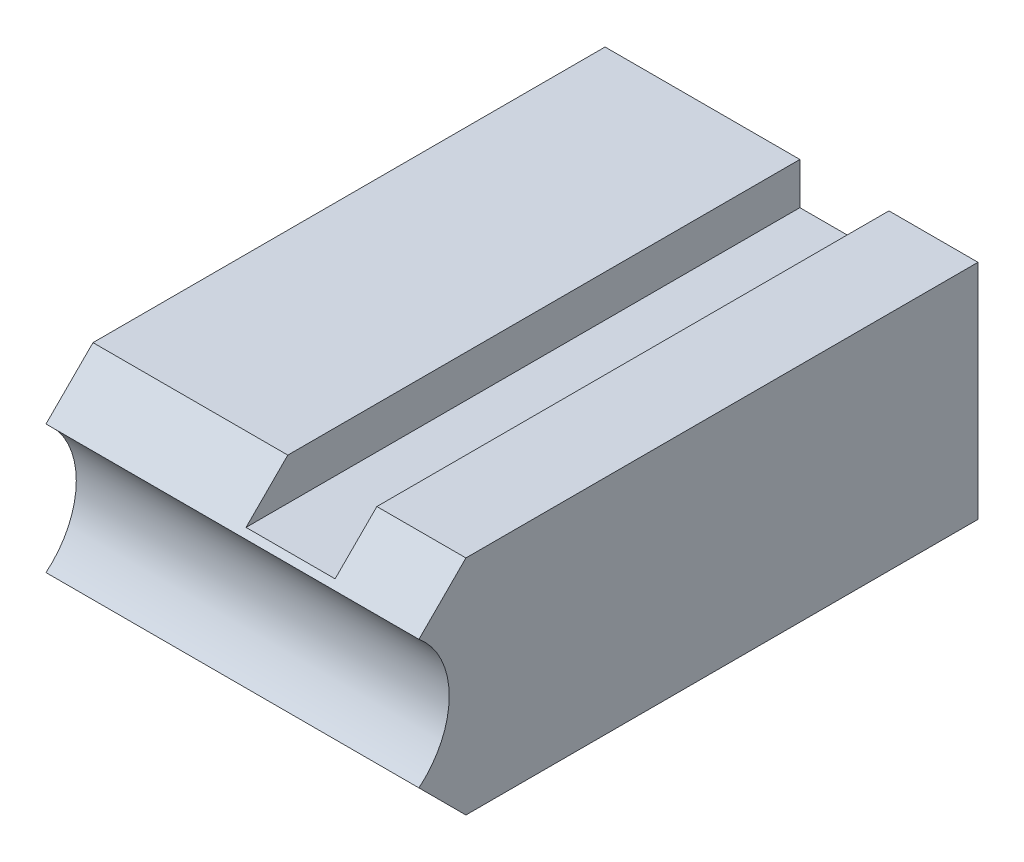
ISO-10303-21;
HEADER;
FILE_DESCRIPTION(('STEP AP214'),'2;1');
FILE_NAME('part.step','',(''),(''),'','','');
FILE_SCHEMA(('AUTOMOTIVE_DESIGN { 1 0 10303 214 1 1 1 1 }'));
ENDSEC;
DATA;
#1=APPLICATION_CONTEXT('core data for automotive mechanical design processes');
#2=APPLICATION_PROTOCOL_DEFINITION('international standard','automotive_design',2000,#1);
#3=PRODUCT_CONTEXT('',#1,'mechanical');
#4=PRODUCT('Part','Part','',(#3));
#5=PRODUCT_RELATED_PRODUCT_CATEGORY('part','',(#4));
#6=PRODUCT_DEFINITION_FORMATION('','',#4);
#7=PRODUCT_DEFINITION_CONTEXT('part definition',#1,'design');
#8=PRODUCT_DEFINITION('design','',#6,#7);
#9=PRODUCT_DEFINITION_SHAPE('','',#8);
#10=(LENGTH_UNIT() NAMED_UNIT(*) SI_UNIT(.MILLI.,.METRE.));
#11=(NAMED_UNIT(*) PLANE_ANGLE_UNIT() SI_UNIT($,.RADIAN.));
#12=(NAMED_UNIT(*) SI_UNIT($,.STERADIAN.) SOLID_ANGLE_UNIT());
#13=UNCERTAINTY_MEASURE_WITH_UNIT(LENGTH_MEASURE(1.E-05),#10,'distance_accuracy_value','');
#14=(GEOMETRIC_REPRESENTATION_CONTEXT(3) GLOBAL_UNCERTAINTY_ASSIGNED_CONTEXT((#13)) GLOBAL_UNIT_ASSIGNED_CONTEXT((#10,
#11,#12)) REPRESENTATION_CONTEXT('',''));
#15=CARTESIAN_POINT('',(0.,0.,0.));
#16=DIRECTION('',(0.,0.,1.));
#17=DIRECTION('',(1.,0.,0.));
#18=AXIS2_PLACEMENT_3D('',#15,#16,#17);
#19=CARTESIAN_POINT('',(118.,12.5,-110.));
#20=DIRECTION('',(0.,1.,0.));
#21=DIRECTION('',(-1.,0.,0.));
#22=AXIS2_PLACEMENT_3D('',#19,#20,#21);
#23=PLANE('',#22);
#24=DIRECTION('',(-1.,0.,0.));
#25=VECTOR('',#24,1.);
#26=CARTESIAN_POINT('',(118.,12.5,-10.5));
#27=LINE('',#26,#25);
#28=CARTESIAN_POINT('',(134.,12.5,-10.5));
#29=VERTEX_POINT('',#28);
#30=CARTESIAN_POINT('',(118.,12.5,-10.5));
#31=VERTEX_POINT('',#30);
#32=EDGE_CURVE('E198',#29,#31,#27,.T.);
#33=ORIENTED_EDGE('',*,*,#32,.F.);
#34=DIRECTION('',(0.,0.,1.));
#35=VECTOR('',#34,1.);
#36=CARTESIAN_POINT('',(134.,12.5,-110.));
#37=LINE('',#36,#35);
#38=CARTESIAN_POINT('',(134.,12.5,-110.));
#39=VERTEX_POINT('',#38);
#40=EDGE_CURVE('E161',#39,#29,#37,.T.);
#41=ORIENTED_EDGE('',*,*,#40,.F.);
#42=DIRECTION('',(-1.,0.,0.));
#43=VECTOR('',#42,1.);
#44=CARTESIAN_POINT('',(118.,12.5,-110.));
#45=LINE('',#44,#43);
#46=CARTESIAN_POINT('',(118.,12.5,-110.));
#47=VERTEX_POINT('',#46);
#48=EDGE_CURVE('E53',#39,#47,#45,.T.);
#49=ORIENTED_EDGE('',*,*,#48,.T.);
#50=DIRECTION('',(0.,0.,1.));
#51=VECTOR('',#50,1.);
#52=CARTESIAN_POINT('',(118.,12.5,-110.));
#53=LINE('',#52,#51);
#54=EDGE_CURVE('E39',#47,#31,#53,.T.);
#55=ORIENTED_EDGE('',*,*,#54,.T.);
#56=EDGE_LOOP('',(#33,#41,#49,#55));
#57=FACE_BOUND('',#56,.T.);
#58=ADVANCED_FACE('F31',(#57),#23,.T.);
#59=CARTESIAN_POINT('',(134.,12.5,-110.));
#60=DIRECTION('',(-1.,0.,0.));
#61=DIRECTION('',(0.,0.,1.));
#62=AXIS2_PLACEMENT_3D('',#59,#60,#61);
#63=PLANE('',#62);
#64=DIRECTION('',(0.,-0.707106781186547,0.707106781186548));
#65=VECTOR('',#64,1.);
#66=CARTESIAN_POINT('',(134.,62.25,-60.25));
#67=LINE('',#66,#65);
#68=CARTESIAN_POINT('',(134.,20.,-18.));
#69=VERTEX_POINT('',#68);
#70=EDGE_CURVE('E195',#69,#29,#67,.T.);
#71=ORIENTED_EDGE('',*,*,#70,.F.);
#72=DIRECTION('',(0.,0.,1.));
#73=VECTOR('',#72,1.);
#74=CARTESIAN_POINT('',(134.,20.,-110.));
#75=LINE('',#74,#73);
#76=CARTESIAN_POINT('',(134.,20.,-110.));
#77=VERTEX_POINT('',#76);
#78=EDGE_CURVE('E151',#77,#69,#75,.T.);
#79=ORIENTED_EDGE('',*,*,#78,.F.);
#80=DIRECTION('',(0.,-1.,0.));
#81=VECTOR('',#80,1.);
#82=CARTESIAN_POINT('',(134.,12.5,-110.));
#83=LINE('',#82,#81);
#84=EDGE_CURVE('E189',#77,#39,#83,.T.);
#85=ORIENTED_EDGE('',*,*,#84,.T.);
#86=ORIENTED_EDGE('',*,*,#40,.T.);
#87=EDGE_LOOP('',(#71,#79,#85,#86));
#88=FACE_BOUND('',#87,.T.);
#89=ADVANCED_FACE('F194',(#88),#63,.T.);
#90=CARTESIAN_POINT('',(134.,20.,-110.));
#91=DIRECTION('',(0.,1.,0.));
#92=DIRECTION('',(0.,0.,1.));
#93=AXIS2_PLACEMENT_3D('',#90,#91,#92);
#94=PLANE('',#93);
#95=DIRECTION('',(-1.,0.,0.));
#96=VECTOR('',#95,1.);
#97=CARTESIAN_POINT('',(150.,20.,-18.));
#98=LINE('',#97,#96);
#99=CARTESIAN_POINT('',(150.,20.,-18.));
#100=VERTEX_POINT('',#99);
#101=EDGE_CURVE('E134',#100,#69,#98,.T.);
#102=ORIENTED_EDGE('',*,*,#101,.F.);
#103=DIRECTION('',(0.,0.,1.));
#104=VECTOR('',#103,1.);
#105=CARTESIAN_POINT('',(150.,20.,-110.));
#106=LINE('',#105,#104);
#107=CARTESIAN_POINT('',(150.,20.,-110.));
#108=VERTEX_POINT('',#107);
#109=EDGE_CURVE('E149',#108,#100,#106,.T.);
#110=ORIENTED_EDGE('',*,*,#109,.F.);
#111=DIRECTION('',(-1.,0.,0.));
#112=VECTOR('',#111,1.);
#113=CARTESIAN_POINT('',(134.,20.,-110.));
#114=LINE('',#113,#112);
#115=EDGE_CURVE('E275',#108,#77,#114,.T.);
#116=ORIENTED_EDGE('',*,*,#115,.T.);
#117=ORIENTED_EDGE('',*,*,#78,.T.);
#118=EDGE_LOOP('',(#102,#110,#116,#117));
#119=FACE_BOUND('',#118,.T.);
#120=ADVANCED_FACE('F147',(#119),#94,.T.);
#121=CARTESIAN_POINT('',(150.,20.,-110.));
#122=DIRECTION('',(1.,0.,0.));
#123=DIRECTION('',(0.,0.,-1.));
#124=AXIS2_PLACEMENT_3D('',#121,#122,#123);
#125=PLANE('',#124);
#126=DIRECTION('',(0.,-0.707106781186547,-0.707106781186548));
#127=VECTOR('',#126,1.);
#128=CARTESIAN_POINT('',(150.,-20.,-18.));
#129=LINE('',#128,#127);
#130=CARTESIAN_POINT('',(150.,-11.5593560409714,-9.55935604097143));
#131=VERTEX_POINT('',#130);
#132=CARTESIAN_POINT('',(150.,-20.,-18.));
#133=VERTEX_POINT('',#132);
#134=EDGE_CURVE('E281',#131,#133,#129,.T.);
#135=ORIENTED_EDGE('',*,*,#134,.T.);
#136=DIRECTION('',(0.,0.,1.));
#137=VECTOR('',#136,1.);
#138=CARTESIAN_POINT('',(150.,-20.,-110.));
#139=LINE('',#138,#137);
#140=CARTESIAN_POINT('',(150.,-20.,-110.));
#141=VERTEX_POINT('',#140);
#142=EDGE_CURVE('E159',#141,#133,#139,.T.);
#143=ORIENTED_EDGE('',*,*,#142,.F.);
#144=DIRECTION('',(0.,1.,0.));
#145=VECTOR('',#144,1.);
#146=CARTESIAN_POINT('',(150.,20.,-110.));
#147=LINE('',#146,#145);
#148=EDGE_CURVE('E158',#141,#108,#147,.T.);
#149=ORIENTED_EDGE('',*,*,#148,.T.);
#150=ORIENTED_EDGE('',*,*,#109,.T.);
#151=DIRECTION('',(0.,-0.707106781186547,0.707106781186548));
#152=VECTOR('',#151,1.);
#153=CARTESIAN_POINT('',(150.,20.,-18.));
#154=LINE('',#153,#152);
#155=CARTESIAN_POINT('',(150.,11.5593560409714,-9.55935604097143));
#156=VERTEX_POINT('',#155);
#157=EDGE_CURVE('E131',#100,#156,#154,.T.);
#158=ORIENTED_EDGE('',*,*,#157,.T.);
#159=CARTESIAN_POINT('',(150.,0.,0.));
#160=DIRECTION('',(-1.,0.,0.));
#161=DIRECTION('',(0.,0.,-1.));
#162=AXIS2_PLACEMENT_3D('',#159,#160,#161);
#163=CIRCLE('',#162,15.);
#164=EDGE_CURVE('E142',#156,#131,#163,.T.);
#165=ORIENTED_EDGE('',*,*,#164,.T.);
#166=EDGE_LOOP('',(#135,#143,#149,#150,#158,#165));
#167=FACE_BOUND('',#166,.T.);
#168=ADVANCED_FACE('F156',(#167),#125,.T.);
#169=CARTESIAN_POINT('',(134.,-20.,-110.));
#170=DIRECTION('',(0.,-1.,0.));
#171=DIRECTION('',(0.,0.,-1.));
#172=AXIS2_PLACEMENT_3D('',#169,#170,#171);
#173=PLANE('',#172);
#174=DIRECTION('',(-1.,0.,0.));
#175=VECTOR('',#174,1.);
#176=CARTESIAN_POINT('',(150.,-20.,-18.));
#177=LINE('',#176,#175);
#178=CARTESIAN_POINT('',(134.,-20.,-18.));
#179=VERTEX_POINT('',#178);
#180=EDGE_CURVE('E250',#133,#179,#177,.T.);
#181=ORIENTED_EDGE('',*,*,#180,.T.);
#182=DIRECTION('',(0.,0.,1.));
#183=VECTOR('',#182,1.);
#184=CARTESIAN_POINT('',(134.,-20.,-110.));
#185=LINE('',#184,#183);
#186=CARTESIAN_POINT('',(134.,-20.,-110.));
#187=VERTEX_POINT('',#186);
#188=EDGE_CURVE('E164',#187,#179,#185,.T.);
#189=ORIENTED_EDGE('',*,*,#188,.F.);
#190=DIRECTION('',(1.,0.,0.));
#191=VECTOR('',#190,1.);
#192=CARTESIAN_POINT('',(134.,-20.,-110.));
#193=LINE('',#192,#191);
#194=EDGE_CURVE('E272',#187,#141,#193,.T.);
#195=ORIENTED_EDGE('',*,*,#194,.T.);
#196=ORIENTED_EDGE('',*,*,#142,.T.);
#197=EDGE_LOOP('',(#181,#189,#195,#196));
#198=FACE_BOUND('',#197,.T.);
#199=ADVANCED_FACE('F266',(#198),#173,.T.);
#200=CARTESIAN_POINT('',(134.,-12.5,-110.));
#201=DIRECTION('',(-1.,0.,0.));
#202=DIRECTION('',(0.,0.,1.));
#203=AXIS2_PLACEMENT_3D('',#200,#201,#202);
#204=PLANE('',#203);
#205=DIRECTION('',(0.,-0.707106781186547,-0.707106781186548));
#206=VECTOR('',#205,1.);
#207=CARTESIAN_POINT('',(134.,-62.25,-60.25));
#208=LINE('',#207,#206);
#209=CARTESIAN_POINT('',(134.,-12.5,-10.5));
#210=VERTEX_POINT('',#209);
#211=EDGE_CURVE('E204',#210,#179,#208,.T.);
#212=ORIENTED_EDGE('',*,*,#211,.F.);
#213=DIRECTION('',(0.,0.,1.));
#214=VECTOR('',#213,1.);
#215=CARTESIAN_POINT('',(134.,-12.5,-110.));
#216=LINE('',#215,#214);
#217=CARTESIAN_POINT('',(134.,-12.5,-110.));
#218=VERTEX_POINT('',#217);
#219=EDGE_CURVE('E170',#218,#210,#216,.T.);
#220=ORIENTED_EDGE('',*,*,#219,.F.);
#221=DIRECTION('',(0.,-1.,0.));
#222=VECTOR('',#221,1.);
#223=CARTESIAN_POINT('',(134.,-12.5,-110.));
#224=LINE('',#223,#222);
#225=EDGE_CURVE('E181',#218,#187,#224,.T.);
#226=ORIENTED_EDGE('',*,*,#225,.T.);
#227=ORIENTED_EDGE('',*,*,#188,.T.);
#228=EDGE_LOOP('',(#212,#220,#226,#227));
#229=FACE_BOUND('',#228,.T.);
#230=ADVANCED_FACE('F270',(#229),#204,.T.);
#231=CARTESIAN_POINT('',(118.,-12.5,-110.));
#232=DIRECTION('',(0.,-1.,0.));
#233=DIRECTION('',(1.,0.,0.));
#234=AXIS2_PLACEMENT_3D('',#231,#232,#233);
#235=PLANE('',#234);
#236=DIRECTION('',(1.,0.,0.));
#237=VECTOR('',#236,1.);
#238=CARTESIAN_POINT('',(118.,-12.5,-10.5));
#239=LINE('',#238,#237);
#240=CARTESIAN_POINT('',(118.,-12.5,-10.5));
#241=VERTEX_POINT('',#240);
#242=EDGE_CURVE('E254',#241,#210,#239,.T.);
#243=ORIENTED_EDGE('',*,*,#242,.F.);
#244=DIRECTION('',(0.,0.,1.));
#245=VECTOR('',#244,1.);
#246=CARTESIAN_POINT('',(118.,-12.5,-110.));
#247=LINE('',#246,#245);
#248=CARTESIAN_POINT('',(118.,-12.5,-110.));
#249=VERTEX_POINT('',#248);
#250=EDGE_CURVE('E173',#249,#241,#247,.T.);
#251=ORIENTED_EDGE('',*,*,#250,.F.);
#252=DIRECTION('',(1.,0.,0.));
#253=VECTOR('',#252,1.);
#254=CARTESIAN_POINT('',(118.,-12.5,-110.));
#255=LINE('',#254,#253);
#256=EDGE_CURVE('E178',#249,#218,#255,.T.);
#257=ORIENTED_EDGE('',*,*,#256,.T.);
#258=ORIENTED_EDGE('',*,*,#219,.T.);
#259=EDGE_LOOP('',(#243,#251,#257,#258));
#260=FACE_BOUND('',#259,.T.);
#261=ADVANCED_FACE('F33',(#260),#235,.T.);
#262=CARTESIAN_POINT('',(118.,12.5,-110.));
#263=DIRECTION('',(0.,0.,-1.));
#264=DIRECTION('',(-1.,0.,0.));
#265=AXIS2_PLACEMENT_3D('',#262,#263,#264);
#266=PLANE('',#265);
#267=ORIENTED_EDGE('',*,*,#256,.F.);
#268=DIRECTION('',(0.,1.,0.));
#269=VECTOR('',#268,1.);
#270=CARTESIAN_POINT('',(118.,20.,-110.));
#271=LINE('',#270,#269);
#272=CARTESIAN_POINT('',(118.,-20.,-110.));
#273=VERTEX_POINT('',#272);
#274=EDGE_CURVE('E220',#273,#249,#271,.T.);
#275=ORIENTED_EDGE('',*,*,#274,.F.);
#276=DIRECTION('',(1.,0.,0.));
#277=VECTOR('',#276,1.);
#278=CARTESIAN_POINT('',(118.,-20.,-110.));
#279=LINE('',#278,#277);
#280=CARTESIAN_POINT('',(83.,-20.,-110.));
#281=VERTEX_POINT('',#280);
#282=EDGE_CURVE('E213',#281,#273,#279,.T.);
#283=ORIENTED_EDGE('',*,*,#282,.F.);
#284=DIRECTION('',(0.,-1.,0.));
#285=VECTOR('',#284,1.);
#286=CARTESIAN_POINT('',(83.,20.,-110.));
#287=LINE('',#286,#285);
#288=CARTESIAN_POINT('',(83.,20.,-110.));
#289=VERTEX_POINT('',#288);
#290=EDGE_CURVE('E227',#289,#281,#287,.T.);
#291=ORIENTED_EDGE('',*,*,#290,.F.);
#292=DIRECTION('',(-1.,0.,0.));
#293=VECTOR('',#292,1.);
#294=CARTESIAN_POINT('',(118.,20.,-110.));
#295=LINE('',#294,#293);
#296=CARTESIAN_POINT('',(118.,20.,-110.));
#297=VERTEX_POINT('',#296);
#298=EDGE_CURVE('E202',#297,#289,#295,.T.);
#299=ORIENTED_EDGE('',*,*,#298,.F.);
#300=EDGE_CURVE('E217',#47,#297,#271,.T.);
#301=ORIENTED_EDGE('',*,*,#300,.F.);
#302=ORIENTED_EDGE('',*,*,#48,.F.);
#303=ORIENTED_EDGE('',*,*,#84,.F.);
#304=ORIENTED_EDGE('',*,*,#115,.F.);
#305=ORIENTED_EDGE('',*,*,#148,.F.);
#306=ORIENTED_EDGE('',*,*,#194,.F.);
#307=ORIENTED_EDGE('',*,*,#225,.F.);
#308=EDGE_LOOP('',(#267,#275,#283,#291,#299,#301,#302,#303,#304,#305,#306,#307));
#309=FACE_BOUND('',#308,.T.);
#310=ADVANCED_FACE('F243',(#309),#266,.T.);
#311=CARTESIAN_POINT('',(118.,20.,-163.150729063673));
#312=DIRECTION('',(1.,0.,0.));
#313=DIRECTION('',(0.,0.,-1.));
#314=AXIS2_PLACEMENT_3D('',#311,#312,#313);
#315=PLANE('',#314);
#316=DIRECTION('',(0.,0.707106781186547,-0.707106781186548));
#317=VECTOR('',#316,1.);
#318=CARTESIAN_POINT('',(118.,92.5753645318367,-90.5753645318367));
#319=LINE('',#318,#317);
#320=CARTESIAN_POINT('',(118.,20.,-18.));
#321=VERTEX_POINT('',#320);
#322=EDGE_CURVE('E200',#31,#321,#319,.T.);
#323=ORIENTED_EDGE('',*,*,#322,.F.);
#324=ORIENTED_EDGE('',*,*,#54,.F.);
#325=ORIENTED_EDGE('',*,*,#300,.T.);
#326=DIRECTION('',(0.,0.,1.));
#327=VECTOR('',#326,1.);
#328=CARTESIAN_POINT('',(118.,20.,-163.150729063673));
#329=LINE('',#328,#327);
#330=EDGE_CURVE('E182',#297,#321,#329,.T.);
#331=ORIENTED_EDGE('',*,*,#330,.T.);
#332=EDGE_LOOP('',(#323,#324,#325,#331));
#333=FACE_BOUND('',#332,.T.);
#334=ADVANCED_FACE('F277',(#333),#315,.T.);
#335=CARTESIAN_POINT('',(118.,20.,-163.150729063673));
#336=DIRECTION('',(0.,1.,0.));
#337=DIRECTION('',(-1.,0.,0.));
#338=AXIS2_PLACEMENT_3D('',#335,#336,#337);
#339=PLANE('',#338);
#340=CARTESIAN_POINT('',(83.,20.,-18.));
#341=VERTEX_POINT('',#340);
#342=EDGE_CURVE('E152',#321,#341,#98,.T.);
#343=ORIENTED_EDGE('',*,*,#342,.F.);
#344=ORIENTED_EDGE('',*,*,#330,.F.);
#345=ORIENTED_EDGE('',*,*,#298,.T.);
#346=DIRECTION('',(0.,0.,1.));
#347=VECTOR('',#346,1.);
#348=CARTESIAN_POINT('',(83.,20.,-163.150729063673));
#349=LINE('',#348,#347);
#350=EDGE_CURVE('E210',#289,#341,#349,.T.);
#351=ORIENTED_EDGE('',*,*,#350,.T.);
#352=EDGE_LOOP('',(#343,#344,#345,#351));
#353=FACE_BOUND('',#352,.T.);
#354=ADVANCED_FACE('F280',(#353),#339,.T.);
#355=CARTESIAN_POINT('',(83.,20.,-163.150729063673));
#356=DIRECTION('',(-1.,0.,0.));
#357=DIRECTION('',(0.,0.,1.));
#358=AXIS2_PLACEMENT_3D('',#355,#356,#357);
#359=PLANE('',#358);
#360=DIRECTION('',(0.,-0.707106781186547,-0.707106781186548));
#361=VECTOR('',#360,1.);
#362=CARTESIAN_POINT('',(83.,-20.,-18.));
#363=LINE('',#362,#361);
#364=CARTESIAN_POINT('',(83.,-11.5593560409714,-9.55935604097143));
#365=VERTEX_POINT('',#364);
#366=CARTESIAN_POINT('',(83.,-20.,-18.));
#367=VERTEX_POINT('',#366);
#368=EDGE_CURVE('E143',#365,#367,#363,.T.);
#369=ORIENTED_EDGE('',*,*,#368,.F.);
#370=CARTESIAN_POINT('',(83.,0.,0.));
#371=DIRECTION('',(-1.,0.,0.));
#372=DIRECTION('',(0.,0.,-1.));
#373=AXIS2_PLACEMENT_3D('',#370,#371,#372);
#374=CIRCLE('',#373,15.);
#375=CARTESIAN_POINT('',(83.,11.5593560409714,-9.55935604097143));
#376=VERTEX_POINT('',#375);
#377=EDGE_CURVE('E286',#376,#365,#374,.T.);
#378=ORIENTED_EDGE('',*,*,#377,.F.);
#379=DIRECTION('',(0.,-0.707106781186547,0.707106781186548));
#380=VECTOR('',#379,1.);
#381=CARTESIAN_POINT('',(83.,20.,-18.));
#382=LINE('',#381,#380);
#383=EDGE_CURVE('E285',#341,#376,#382,.T.);
#384=ORIENTED_EDGE('',*,*,#383,.F.);
#385=ORIENTED_EDGE('',*,*,#350,.F.);
#386=ORIENTED_EDGE('',*,*,#290,.T.);
#387=DIRECTION('',(0.,0.,1.));
#388=VECTOR('',#387,1.);
#389=CARTESIAN_POINT('',(83.,-20.,-163.150729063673));
#390=LINE('',#389,#388);
#391=EDGE_CURVE('E228',#281,#367,#390,.T.);
#392=ORIENTED_EDGE('',*,*,#391,.T.);
#393=EDGE_LOOP('',(#369,#378,#384,#385,#386,#392));
#394=FACE_BOUND('',#393,.T.);
#395=ADVANCED_FACE('F237',(#394),#359,.T.);
#396=CARTESIAN_POINT('',(118.,-20.,-163.150729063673));
#397=DIRECTION('',(0.,-1.,0.));
#398=DIRECTION('',(1.,0.,0.));
#399=AXIS2_PLACEMENT_3D('',#396,#397,#398);
#400=PLANE('',#399);
#401=CARTESIAN_POINT('',(118.,-20.,-17.9999999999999));
#402=VERTEX_POINT('',#401);
#403=EDGE_CURVE('E45',#402,#367,#177,.T.);
#404=ORIENTED_EDGE('',*,*,#403,.T.);
#405=ORIENTED_EDGE('',*,*,#391,.F.);
#406=ORIENTED_EDGE('',*,*,#282,.T.);
#407=DIRECTION('',(0.,0.,1.));
#408=VECTOR('',#407,1.);
#409=CARTESIAN_POINT('',(118.,-20.,-163.150729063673));
#410=LINE('',#409,#408);
#411=EDGE_CURVE('E231',#273,#402,#410,.T.);
#412=ORIENTED_EDGE('',*,*,#411,.T.);
#413=EDGE_LOOP('',(#404,#405,#406,#412));
#414=FACE_BOUND('',#413,.T.);
#415=ADVANCED_FACE('F249',(#414),#400,.T.);
#416=DIRECTION('',(0.,0.707106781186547,0.707106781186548));
#417=VECTOR('',#416,1.);
#418=CARTESIAN_POINT('',(118.,-72.5753645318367,-70.5753645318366));
#419=LINE('',#418,#417);
#420=EDGE_CURVE('E11',#402,#241,#419,.T.);
#421=ORIENTED_EDGE('',*,*,#420,.F.);
#422=ORIENTED_EDGE('',*,*,#411,.F.);
#423=ORIENTED_EDGE('',*,*,#274,.T.);
#424=ORIENTED_EDGE('',*,*,#250,.T.);
#425=EDGE_LOOP('',(#421,#422,#423,#424));
#426=FACE_BOUND('',#425,.T.);
#427=ADVANCED_FACE('F298',(#426),#315,.T.);
#428=CARTESIAN_POINT('',(150.,-20.,-18.));
#429=DIRECTION('',(0.,0.707106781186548,-0.707106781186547));
#430=DIRECTION('',(0.,0.707106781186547,0.707106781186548));
#431=AXIS2_PLACEMENT_3D('',#428,#429,#430);
#432=PLANE('',#431);
#433=ORIENTED_EDGE('',*,*,#211,.T.);
#434=ORIENTED_EDGE('',*,*,#180,.F.);
#435=ORIENTED_EDGE('',*,*,#134,.F.);
#436=DIRECTION('',(-1.,0.,0.));
#437=VECTOR('',#436,1.);
#438=CARTESIAN_POINT('',(150.,-11.5593560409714,-9.55935604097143));
#439=LINE('',#438,#437);
#440=EDGE_CURVE('E251',#131,#365,#439,.T.);
#441=ORIENTED_EDGE('',*,*,#440,.T.);
#442=ORIENTED_EDGE('',*,*,#368,.T.);
#443=ORIENTED_EDGE('',*,*,#403,.F.);
#444=ORIENTED_EDGE('',*,*,#420,.T.);
#445=ORIENTED_EDGE('',*,*,#242,.T.);
#446=EDGE_LOOP('',(#433,#434,#435,#441,#442,#443,#444,#445));
#447=FACE_BOUND('',#446,.T.);
#448=ADVANCED_FACE('F261',(#447),#432,.F.);
#449=CARTESIAN_POINT('',(150.,0.,0.));
#450=DIRECTION('',(-1.,0.,0.));
#451=DIRECTION('',(0.,0.,1.));
#452=AXIS2_PLACEMENT_3D('',#449,#450,#451);
#453=CYLINDRICAL_SURFACE('',#452,15.);
#454=ORIENTED_EDGE('',*,*,#377,.T.);
#455=ORIENTED_EDGE('',*,*,#440,.F.);
#456=ORIENTED_EDGE('',*,*,#164,.F.);
#457=DIRECTION('',(-1.,0.,0.));
#458=VECTOR('',#457,1.);
#459=CARTESIAN_POINT('',(150.,11.5593560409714,-9.55935604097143));
#460=LINE('',#459,#458);
#461=EDGE_CURVE('E137',#156,#376,#460,.T.);
#462=ORIENTED_EDGE('',*,*,#461,.T.);
#463=EDGE_LOOP('',(#454,#455,#456,#462));
#464=FACE_BOUND('',#463,.T.);
#465=ADVANCED_FACE('F290',(#464),#453,.F.);
#466=CARTESIAN_POINT('',(150.,20.,-18.));
#467=DIRECTION('',(0.,-0.707106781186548,-0.707106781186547));
#468=DIRECTION('',(0.,0.707106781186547,-0.707106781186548));
#469=AXIS2_PLACEMENT_3D('',#466,#467,#468);
#470=PLANE('',#469);
#471=ORIENTED_EDGE('',*,*,#70,.T.);
#472=ORIENTED_EDGE('',*,*,#32,.T.);
#473=ORIENTED_EDGE('',*,*,#322,.T.);
#474=ORIENTED_EDGE('',*,*,#342,.T.);
#475=ORIENTED_EDGE('',*,*,#383,.T.);
#476=ORIENTED_EDGE('',*,*,#461,.F.);
#477=ORIENTED_EDGE('',*,*,#157,.F.);
#478=ORIENTED_EDGE('',*,*,#101,.T.);
#479=EDGE_LOOP('',(#471,#472,#473,#474,#475,#476,#477,#478));
#480=FACE_BOUND('',#479,.T.);
#481=ADVANCED_FACE('F133',(#480),#470,.F.);
#482=CLOSED_SHELL('',(#58,#89,#120,#168,#199,#230,#261,#310,#334,#354,#395,#415,#427,#448,#465,#481));
#483=MANIFOLD_SOLID_BREP('B2',#482);
#484=ADVANCED_BREP_SHAPE_REPRESENTATION('',(#18,#483),#14);
#485=SHAPE_DEFINITION_REPRESENTATION(#9,#484);
ENDSEC;
END-ISO-10303-21;
